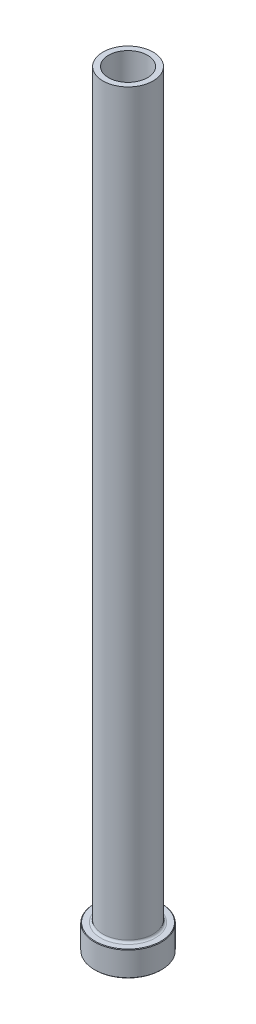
from build123d import *

# Parameters (mm, degrees)
FILLET1_R     = 0.8
CHAMFER1_SIZE = 0.2
CHAMFER3_SIZE = 0.5


with BuildPart() as part:
    # Sketch1 → Revolve1 (revolve)
    with BuildSketch(Plane.XY, mode=Mode.PRIVATE) as revolve1_sk:
        Polygon((-7, 275), (-9, 275), (-9, 9), (-12, 9), (-12, 0), (-7.25, 0), (-7.25, 208), (-7, 220), align=None)
    revolve(revolve1_sk.sketch.rotate(Axis((0, 92.187680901, 0), (0, -1, 0)), 270), axis=Axis((0, 92.187680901, 0), (0, -1, 0)))

    # Fillet1
    fillet1_edges = [part.edges().sort_by_distance(p)[0] for p in [
        (0, 9, -9),
    ]]
    fillet(fillet1_edges, radius=FILLET1_R)

    # Chamfer1
    chamfer1_edges = [part.edges().sort_by_distance(p)[0] for p in [
        (0, 0, -12),
        (0, 9, -12),
    ]]
    chamfer(chamfer1_edges, length=CHAMFER1_SIZE)

    # Chamfer3
    chamfer3_edges = [part.edges().sort_by_distance(p)[0] for p in [
        (0, 0, -7.25),
    ]]
    chamfer(chamfer3_edges, length=CHAMFER3_SIZE)


solid = part.part
